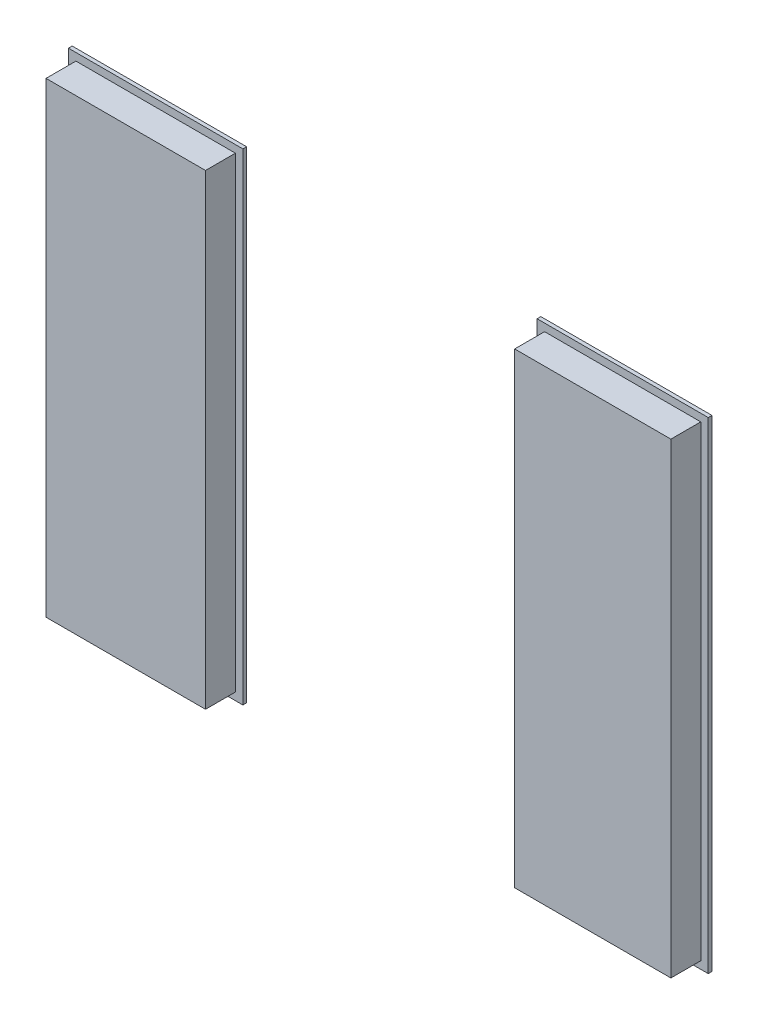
ISO-10303-21;
HEADER;
FILE_DESCRIPTION(('STEP AP214'),'2;1');
FILE_NAME('part.step','',(''),(''),'','','');
FILE_SCHEMA(('AUTOMOTIVE_DESIGN { 1 0 10303 214 1 1 1 1 }'));
ENDSEC;
DATA;
#1=APPLICATION_CONTEXT('core data for automotive mechanical design processes');
#2=APPLICATION_PROTOCOL_DEFINITION('international standard','automotive_design',2000,#1);
#3=PRODUCT_CONTEXT('',#1,'mechanical');
#4=PRODUCT('Part','Part','',(#3));
#5=PRODUCT_RELATED_PRODUCT_CATEGORY('part','',(#4));
#6=PRODUCT_DEFINITION_FORMATION('','',#4);
#7=PRODUCT_DEFINITION_CONTEXT('part definition',#1,'design');
#8=PRODUCT_DEFINITION('design','',#6,#7);
#9=PRODUCT_DEFINITION_SHAPE('','',#8);
#10=(LENGTH_UNIT() NAMED_UNIT(*) SI_UNIT(.MILLI.,.METRE.));
#11=(NAMED_UNIT(*) PLANE_ANGLE_UNIT() SI_UNIT($,.RADIAN.));
#12=(NAMED_UNIT(*) SI_UNIT($,.STERADIAN.) SOLID_ANGLE_UNIT());
#13=UNCERTAINTY_MEASURE_WITH_UNIT(LENGTH_MEASURE(1.E-05),#10,'distance_accuracy_value','');
#14=(GEOMETRIC_REPRESENTATION_CONTEXT(3) GLOBAL_UNCERTAINTY_ASSIGNED_CONTEXT((#13)) GLOBAL_UNIT_ASSIGNED_CONTEXT((#10,
#11,#12)) REPRESENTATION_CONTEXT('',''));
#15=CARTESIAN_POINT('',(0.,0.,0.));
#16=DIRECTION('',(0.,0.,1.));
#17=DIRECTION('',(1.,0.,0.));
#18=AXIS2_PLACEMENT_3D('',#15,#16,#17);
#19=CARTESIAN_POINT('',(84.3188543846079,0.,0.25));
#20=DIRECTION('',(-1.,0.,0.));
#21=DIRECTION('',(0.,0.,1.));
#22=AXIS2_PLACEMENT_3D('',#19,#20,#21);
#23=PLANE('',#22);
#24=DIRECTION('',(0.,1.,0.));
#25=VECTOR('',#24,1.);
#26=CARTESIAN_POINT('',(84.3188543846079,0.,0.));
#27=LINE('',#26,#25);
#28=CARTESIAN_POINT('',(84.3188543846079,58.1460403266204,0.));
#29=VERTEX_POINT('',#28);
#30=CARTESIAN_POINT('',(84.3188543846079,90.3740492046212,0.));
#31=VERTEX_POINT('',#30);
#32=EDGE_CURVE('E151',#29,#31,#27,.T.);
#33=ORIENTED_EDGE('',*,*,#32,.T.);
#34=DIRECTION('',(0.,0.,-1.));
#35=VECTOR('',#34,1.);
#36=CARTESIAN_POINT('',(84.3188543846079,90.3740492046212,0.25));
#37=LINE('',#36,#35);
#38=CARTESIAN_POINT('',(84.3188543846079,90.3740492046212,0.25));
#39=VERTEX_POINT('',#38);
#40=EDGE_CURVE('E12',#39,#31,#37,.T.);
#41=ORIENTED_EDGE('',*,*,#40,.F.);
#42=DIRECTION('',(0.,1.,0.));
#43=VECTOR('',#42,1.);
#44=CARTESIAN_POINT('',(84.3188543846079,0.,0.25));
#45=LINE('',#44,#43);
#46=CARTESIAN_POINT('',(84.3188543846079,58.1460403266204,0.25));
#47=VERTEX_POINT('',#46);
#48=EDGE_CURVE('E125',#47,#39,#45,.T.);
#49=ORIENTED_EDGE('',*,*,#48,.F.);
#50=DIRECTION('',(0.,0.,-1.));
#51=VECTOR('',#50,1.);
#52=CARTESIAN_POINT('',(84.3188543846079,58.1460403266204,0.25));
#53=LINE('',#52,#51);
#54=EDGE_CURVE('E158',#47,#29,#53,.T.);
#55=ORIENTED_EDGE('',*,*,#54,.T.);
#56=EDGE_LOOP('',(#33,#41,#49,#55));
#57=FACE_BOUND('',#56,.T.);
#58=ADVANCED_FACE('F44',(#57),#23,.F.);
#59=CARTESIAN_POINT('',(0.,90.3740492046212,0.25));
#60=DIRECTION('',(0.,-1.,0.));
#61=DIRECTION('',(0.,0.,-1.));
#62=AXIS2_PLACEMENT_3D('',#59,#60,#61);
#63=PLANE('',#62);
#64=DIRECTION('',(-1.,0.,0.));
#65=VECTOR('',#64,1.);
#66=CARTESIAN_POINT('',(0.,90.3740492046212,0.));
#67=LINE('',#66,#65);
#68=CARTESIAN_POINT('',(72.8657810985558,90.3740492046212,0.));
#69=VERTEX_POINT('',#68);
#70=EDGE_CURVE('E130',#31,#69,#67,.T.);
#71=ORIENTED_EDGE('',*,*,#70,.T.);
#72=DIRECTION('',(0.,0.,-1.));
#73=VECTOR('',#72,1.);
#74=CARTESIAN_POINT('',(72.8657810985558,90.3740492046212,0.25));
#75=LINE('',#74,#73);
#76=CARTESIAN_POINT('',(72.8657810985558,90.3740492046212,0.25));
#77=VERTEX_POINT('',#76);
#78=EDGE_CURVE('E54',#77,#69,#75,.T.);
#79=ORIENTED_EDGE('',*,*,#78,.F.);
#80=DIRECTION('',(-1.,0.,0.));
#81=VECTOR('',#80,1.);
#82=CARTESIAN_POINT('',(0.,90.3740492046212,0.25));
#83=LINE('',#82,#81);
#84=EDGE_CURVE('E119',#39,#77,#83,.T.);
#85=ORIENTED_EDGE('',*,*,#84,.F.);
#86=ORIENTED_EDGE('',*,*,#40,.T.);
#87=EDGE_LOOP('',(#71,#79,#85,#86));
#88=FACE_BOUND('',#87,.T.);
#89=ADVANCED_FACE('F129',(#88),#63,.F.);
#90=CARTESIAN_POINT('',(72.8657810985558,0.,0.25));
#91=DIRECTION('',(1.,0.,0.));
#92=DIRECTION('',(0.,0.,-1.));
#93=AXIS2_PLACEMENT_3D('',#90,#91,#92);
#94=PLANE('',#93);
#95=DIRECTION('',(0.,-1.,0.));
#96=VECTOR('',#95,1.);
#97=CARTESIAN_POINT('',(72.8657810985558,0.,0.));
#98=LINE('',#97,#96);
#99=CARTESIAN_POINT('',(72.8657810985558,58.1460403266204,0.));
#100=VERTEX_POINT('',#99);
#101=EDGE_CURVE('E92',#69,#100,#98,.T.);
#102=ORIENTED_EDGE('',*,*,#101,.T.);
#103=DIRECTION('',(0.,0.,-1.));
#104=VECTOR('',#103,1.);
#105=CARTESIAN_POINT('',(72.8657810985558,58.1460403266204,0.25));
#106=LINE('',#105,#104);
#107=CARTESIAN_POINT('',(72.8657810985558,58.1460403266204,0.25));
#108=VERTEX_POINT('',#107);
#109=EDGE_CURVE('E131',#108,#100,#106,.T.);
#110=ORIENTED_EDGE('',*,*,#109,.F.);
#111=DIRECTION('',(0.,-1.,0.));
#112=VECTOR('',#111,1.);
#113=CARTESIAN_POINT('',(72.8657810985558,0.,0.25));
#114=LINE('',#113,#112);
#115=EDGE_CURVE('E123',#77,#108,#114,.T.);
#116=ORIENTED_EDGE('',*,*,#115,.F.);
#117=ORIENTED_EDGE('',*,*,#78,.T.);
#118=EDGE_LOOP('',(#102,#110,#116,#117));
#119=FACE_BOUND('',#118,.T.);
#120=ADVANCED_FACE('F133',(#119),#94,.F.);
#121=CARTESIAN_POINT('',(0.,89.8740492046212,0.25));
#122=DIRECTION('',(0.,-1.,0.));
#123=DIRECTION('',(0.,0.,-1.));
#124=AXIS2_PLACEMENT_3D('',#121,#122,#123);
#125=PLANE('',#124);
#126=DIRECTION('',(-1.,0.,0.));
#127=VECTOR('',#126,1.);
#128=CARTESIAN_POINT('',(0.,89.8740492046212,0.));
#129=LINE('',#128,#127);
#130=CARTESIAN_POINT('',(83.8188543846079,89.8740492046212,0.));
#131=VERTEX_POINT('',#130);
#132=CARTESIAN_POINT('',(73.3657810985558,89.8740492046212,0.));
#133=VERTEX_POINT('',#132);
#134=EDGE_CURVE('E139',#131,#133,#129,.T.);
#135=ORIENTED_EDGE('',*,*,#134,.F.);
#136=DIRECTION('',(0.,0.,-1.));
#137=VECTOR('',#136,1.);
#138=CARTESIAN_POINT('',(83.8188543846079,89.8740492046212,0.25));
#139=LINE('',#138,#137);
#140=CARTESIAN_POINT('',(83.8188543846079,89.8740492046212,0.25));
#141=VERTEX_POINT('',#140);
#142=EDGE_CURVE('E48',#141,#131,#139,.T.);
#143=ORIENTED_EDGE('',*,*,#142,.F.);
#144=DIRECTION('',(-1.,0.,0.));
#145=VECTOR('',#144,1.);
#146=CARTESIAN_POINT('',(0.,89.8740492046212,0.25));
#147=LINE('',#146,#145);
#148=CARTESIAN_POINT('',(73.3657810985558,89.8740492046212,0.25));
#149=VERTEX_POINT('',#148);
#150=EDGE_CURVE('E157',#141,#149,#147,.T.);
#151=ORIENTED_EDGE('',*,*,#150,.T.);
#152=DIRECTION('',(0.,0.,-1.));
#153=VECTOR('',#152,1.);
#154=CARTESIAN_POINT('',(73.3657810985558,89.8740492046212,0.25));
#155=LINE('',#154,#153);
#156=EDGE_CURVE('E135',#149,#133,#155,.T.);
#157=ORIENTED_EDGE('',*,*,#156,.T.);
#158=EDGE_LOOP('',(#135,#143,#151,#157));
#159=FACE_BOUND('',#158,.T.);
#160=ADVANCED_FACE('F46',(#159),#125,.T.);
#161=CARTESIAN_POINT('',(83.8188543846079,0.,0.25));
#162=DIRECTION('',(-1.,0.,0.));
#163=DIRECTION('',(0.,0.,1.));
#164=AXIS2_PLACEMENT_3D('',#161,#162,#163);
#165=PLANE('',#164);
#166=DIRECTION('',(0.,1.,0.));
#167=VECTOR('',#166,1.);
#168=CARTESIAN_POINT('',(83.8188543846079,0.,0.));
#169=LINE('',#168,#167);
#170=CARTESIAN_POINT('',(83.8188543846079,58.6460403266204,0.));
#171=VERTEX_POINT('',#170);
#172=EDGE_CURVE('E142',#171,#131,#169,.T.);
#173=ORIENTED_EDGE('',*,*,#172,.F.);
#174=DIRECTION('',(0.,0.,-1.));
#175=VECTOR('',#174,1.);
#176=CARTESIAN_POINT('',(83.8188543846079,58.6460403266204,0.25));
#177=LINE('',#176,#175);
#178=CARTESIAN_POINT('',(83.8188543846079,58.6460403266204,0.25));
#179=VERTEX_POINT('',#178);
#180=EDGE_CURVE('E163',#179,#171,#177,.T.);
#181=ORIENTED_EDGE('',*,*,#180,.F.);
#182=DIRECTION('',(0.,1.,0.));
#183=VECTOR('',#182,1.);
#184=CARTESIAN_POINT('',(83.8188543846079,0.,0.25));
#185=LINE('',#184,#183);
#186=EDGE_CURVE('E172',#179,#141,#185,.T.);
#187=ORIENTED_EDGE('',*,*,#186,.T.);
#188=ORIENTED_EDGE('',*,*,#142,.T.);
#189=EDGE_LOOP('',(#173,#181,#187,#188));
#190=FACE_BOUND('',#189,.T.);
#191=ADVANCED_FACE('F170',(#190),#165,.T.);
#192=CARTESIAN_POINT('',(0.,58.6460403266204,0.25));
#193=DIRECTION('',(0.,1.,0.));
#194=DIRECTION('',(0.,0.,1.));
#195=AXIS2_PLACEMENT_3D('',#192,#193,#194);
#196=PLANE('',#195);
#197=DIRECTION('',(1.,0.,0.));
#198=VECTOR('',#197,1.);
#199=CARTESIAN_POINT('',(0.,58.6460403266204,0.));
#200=LINE('',#199,#198);
#201=CARTESIAN_POINT('',(73.3657810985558,58.6460403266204,0.));
#202=VERTEX_POINT('',#201);
#203=EDGE_CURVE('E145',#202,#171,#200,.T.);
#204=ORIENTED_EDGE('',*,*,#203,.F.);
#205=DIRECTION('',(0.,0.,-1.));
#206=VECTOR('',#205,1.);
#207=CARTESIAN_POINT('',(73.3657810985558,58.6460403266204,0.25));
#208=LINE('',#207,#206);
#209=CARTESIAN_POINT('',(73.3657810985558,58.6460403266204,0.25));
#210=VERTEX_POINT('',#209);
#211=EDGE_CURVE('E162',#210,#202,#208,.T.);
#212=ORIENTED_EDGE('',*,*,#211,.F.);
#213=DIRECTION('',(1.,0.,0.));
#214=VECTOR('',#213,1.);
#215=CARTESIAN_POINT('',(0.,58.6460403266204,0.25));
#216=LINE('',#215,#214);
#217=EDGE_CURVE('E179',#210,#179,#216,.T.);
#218=ORIENTED_EDGE('',*,*,#217,.T.);
#219=ORIENTED_EDGE('',*,*,#180,.T.);
#220=EDGE_LOOP('',(#204,#212,#218,#219));
#221=FACE_BOUND('',#220,.T.);
#222=ADVANCED_FACE('F177',(#221),#196,.T.);
#223=CARTESIAN_POINT('',(73.3657810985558,0.,0.25));
#224=DIRECTION('',(1.,0.,0.));
#225=DIRECTION('',(0.,0.,-1.));
#226=AXIS2_PLACEMENT_3D('',#223,#224,#225);
#227=PLANE('',#226);
#228=DIRECTION('',(0.,-1.,0.));
#229=VECTOR('',#228,1.);
#230=CARTESIAN_POINT('',(73.3657810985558,0.,0.));
#231=LINE('',#230,#229);
#232=EDGE_CURVE('E148',#133,#202,#231,.T.);
#233=ORIENTED_EDGE('',*,*,#232,.F.);
#234=ORIENTED_EDGE('',*,*,#156,.F.);
#235=DIRECTION('',(0.,-1.,0.));
#236=VECTOR('',#235,1.);
#237=CARTESIAN_POINT('',(73.3657810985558,0.,0.25));
#238=LINE('',#237,#236);
#239=EDGE_CURVE('E184',#149,#210,#238,.T.);
#240=ORIENTED_EDGE('',*,*,#239,.T.);
#241=ORIENTED_EDGE('',*,*,#211,.T.);
#242=EDGE_LOOP('',(#233,#234,#240,#241));
#243=FACE_BOUND('',#242,.T.);
#244=ADVANCED_FACE('F186',(#243),#227,.T.);
#245=CARTESIAN_POINT('',(0.,58.1460403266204,0.25));
#246=DIRECTION('',(0.,1.,0.));
#247=DIRECTION('',(0.,0.,1.));
#248=AXIS2_PLACEMENT_3D('',#245,#246,#247);
#249=PLANE('',#248);
#250=DIRECTION('',(1.,0.,0.));
#251=VECTOR('',#250,1.);
#252=CARTESIAN_POINT('',(0.,58.1460403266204,0.));
#253=LINE('',#252,#251);
#254=EDGE_CURVE('E98',#100,#29,#253,.T.);
#255=ORIENTED_EDGE('',*,*,#254,.T.);
#256=ORIENTED_EDGE('',*,*,#54,.F.);
#257=DIRECTION('',(1.,0.,0.));
#258=VECTOR('',#257,1.);
#259=CARTESIAN_POINT('',(0.,58.1460403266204,0.25));
#260=LINE('',#259,#258);
#261=EDGE_CURVE('E63',#108,#47,#260,.T.);
#262=ORIENTED_EDGE('',*,*,#261,.F.);
#263=ORIENTED_EDGE('',*,*,#109,.T.);
#264=EDGE_LOOP('',(#255,#256,#262,#263));
#265=FACE_BOUND('',#264,.T.);
#266=ADVANCED_FACE('F191',(#265),#249,.F.);
#267=CARTESIAN_POINT('',(0.,0.,0.25));
#268=DIRECTION('',(0.,0.,1.));
#269=DIRECTION('',(1.,0.,0.));
#270=AXIS2_PLACEMENT_3D('',#267,#268,#269);
#271=PLANE('',#270);
#272=ORIENTED_EDGE('',*,*,#150,.F.);
#273=ORIENTED_EDGE('',*,*,#186,.F.);
#274=ORIENTED_EDGE('',*,*,#217,.F.);
#275=ORIENTED_EDGE('',*,*,#239,.F.);
#276=EDGE_LOOP('',(#272,#273,#274,#275));
#277=FACE_BOUND('',#276,.T.);
#278=ORIENTED_EDGE('',*,*,#48,.T.);
#279=ORIENTED_EDGE('',*,*,#84,.T.);
#280=ORIENTED_EDGE('',*,*,#115,.T.);
#281=ORIENTED_EDGE('',*,*,#261,.T.);
#282=EDGE_LOOP('',(#278,#279,#280,#281));
#283=FACE_BOUND('',#282,.T.);
#284=ADVANCED_FACE('F121',(#277,#283),#271,.T.);
#285=CARTESIAN_POINT('',(0.,0.,0.));
#286=DIRECTION('',(0.,0.,1.));
#287=DIRECTION('',(1.,0.,0.));
#288=AXIS2_PLACEMENT_3D('',#285,#286,#287);
#289=PLANE('',#288);
#290=ORIENTED_EDGE('',*,*,#134,.T.);
#291=ORIENTED_EDGE('',*,*,#232,.T.);
#292=ORIENTED_EDGE('',*,*,#203,.T.);
#293=ORIENTED_EDGE('',*,*,#172,.T.);
#294=EDGE_LOOP('',(#290,#291,#292,#293));
#295=FACE_BOUND('',#294,.T.);
#296=ORIENTED_EDGE('',*,*,#32,.F.);
#297=ORIENTED_EDGE('',*,*,#254,.F.);
#298=ORIENTED_EDGE('',*,*,#101,.F.);
#299=ORIENTED_EDGE('',*,*,#70,.F.);
#300=EDGE_LOOP('',(#296,#297,#298,#299));
#301=FACE_BOUND('',#300,.T.);
#302=ADVANCED_FACE('F175',(#295,#301),#289,.F.);
#303=CLOSED_SHELL('',(#58,#89,#120,#160,#191,#222,#244,#266,#284,#302));
#304=MANIFOLD_SOLID_BREP('B2',#303);
#305=CARTESIAN_POINT('',(83.8188543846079,0.,2.25));
#306=DIRECTION('',(-1.,0.,0.));
#307=DIRECTION('',(0.,0.,1.));
#308=AXIS2_PLACEMENT_3D('',#305,#306,#307);
#309=PLANE('',#308);
#310=DIRECTION('',(0.,1.,0.));
#311=VECTOR('',#310,1.);
#312=CARTESIAN_POINT('',(83.8188543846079,0.,0.));
#313=LINE('',#312,#311);
#314=CARTESIAN_POINT('',(83.8188543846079,58.6460403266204,0.));
#315=VERTEX_POINT('',#314);
#316=CARTESIAN_POINT('',(83.8188543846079,89.8740492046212,0.));
#317=VERTEX_POINT('',#316);
#318=EDGE_CURVE('E346',#315,#317,#313,.T.);
#319=ORIENTED_EDGE('',*,*,#318,.T.);
#320=DIRECTION('',(0.,0.,-1.));
#321=VECTOR('',#320,1.);
#322=CARTESIAN_POINT('',(83.8188543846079,89.8740492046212,2.25));
#323=LINE('',#322,#321);
#324=CARTESIAN_POINT('',(83.8188543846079,89.8740492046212,2.25));
#325=VERTEX_POINT('',#324);
#326=EDGE_CURVE('E42',#325,#317,#323,.T.);
#327=ORIENTED_EDGE('',*,*,#326,.F.);
#328=DIRECTION('',(0.,1.,0.));
#329=VECTOR('',#328,1.);
#330=CARTESIAN_POINT('',(83.8188543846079,0.,2.25));
#331=LINE('',#330,#329);
#332=CARTESIAN_POINT('',(83.8188543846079,58.6460403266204,2.25));
#333=VERTEX_POINT('',#332);
#334=EDGE_CURVE('E334',#333,#325,#331,.T.);
#335=ORIENTED_EDGE('',*,*,#334,.F.);
#336=DIRECTION('',(0.,0.,-1.));
#337=VECTOR('',#336,1.);
#338=CARTESIAN_POINT('',(83.8188543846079,58.6460403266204,2.25));
#339=LINE('',#338,#337);
#340=EDGE_CURVE('E342',#333,#315,#339,.T.);
#341=ORIENTED_EDGE('',*,*,#340,.T.);
#342=EDGE_LOOP('',(#319,#327,#335,#341));
#343=FACE_BOUND('',#342,.T.);
#344=ADVANCED_FACE('F283',(#343),#309,.F.);
#345=CARTESIAN_POINT('',(0.,89.8740492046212,2.25));
#346=DIRECTION('',(0.,-1.,0.));
#347=DIRECTION('',(0.,0.,-1.));
#348=AXIS2_PLACEMENT_3D('',#345,#346,#347);
#349=PLANE('',#348);
#350=DIRECTION('',(-1.,0.,0.));
#351=VECTOR('',#350,1.);
#352=CARTESIAN_POINT('',(0.,89.8740492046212,0.));
#353=LINE('',#352,#351);
#354=CARTESIAN_POINT('',(73.3657810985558,89.8740492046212,0.));
#355=VERTEX_POINT('',#354);
#356=EDGE_CURVE('E338',#317,#355,#353,.T.);
#357=ORIENTED_EDGE('',*,*,#356,.T.);
#358=DIRECTION('',(0.,0.,-1.));
#359=VECTOR('',#358,1.);
#360=CARTESIAN_POINT('',(73.3657810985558,89.8740492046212,2.25));
#361=LINE('',#360,#359);
#362=CARTESIAN_POINT('',(73.3657810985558,89.8740492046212,2.25));
#363=VERTEX_POINT('',#362);
#364=EDGE_CURVE('E291',#363,#355,#361,.T.);
#365=ORIENTED_EDGE('',*,*,#364,.F.);
#366=DIRECTION('',(-1.,0.,0.));
#367=VECTOR('',#366,1.);
#368=CARTESIAN_POINT('',(0.,89.8740492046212,2.25));
#369=LINE('',#368,#367);
#370=EDGE_CURVE('E329',#325,#363,#369,.T.);
#371=ORIENTED_EDGE('',*,*,#370,.F.);
#372=ORIENTED_EDGE('',*,*,#326,.T.);
#373=EDGE_LOOP('',(#357,#365,#371,#372));
#374=FACE_BOUND('',#373,.T.);
#375=ADVANCED_FACE('F337',(#374),#349,.F.);
#376=CARTESIAN_POINT('',(73.3657810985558,0.,2.25));
#377=DIRECTION('',(1.,0.,0.));
#378=DIRECTION('',(0.,0.,-1.));
#379=AXIS2_PLACEMENT_3D('',#376,#377,#378);
#380=PLANE('',#379);
#381=DIRECTION('',(0.,-1.,0.));
#382=VECTOR('',#381,1.);
#383=CARTESIAN_POINT('',(73.3657810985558,0.,0.));
#384=LINE('',#383,#382);
#385=CARTESIAN_POINT('',(73.3657810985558,58.6460403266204,0.));
#386=VERTEX_POINT('',#385);
#387=EDGE_CURVE('E316',#355,#386,#384,.T.);
#388=ORIENTED_EDGE('',*,*,#387,.T.);
#389=DIRECTION('',(0.,0.,-1.));
#390=VECTOR('',#389,1.);
#391=CARTESIAN_POINT('',(73.3657810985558,58.6460403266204,2.25));
#392=LINE('',#391,#390);
#393=CARTESIAN_POINT('',(73.3657810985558,58.6460403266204,2.25));
#394=VERTEX_POINT('',#393);
#395=EDGE_CURVE('E339',#394,#386,#392,.T.);
#396=ORIENTED_EDGE('',*,*,#395,.F.);
#397=DIRECTION('',(0.,-1.,0.));
#398=VECTOR('',#397,1.);
#399=CARTESIAN_POINT('',(73.3657810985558,0.,2.25));
#400=LINE('',#399,#398);
#401=EDGE_CURVE('E332',#363,#394,#400,.T.);
#402=ORIENTED_EDGE('',*,*,#401,.F.);
#403=ORIENTED_EDGE('',*,*,#364,.T.);
#404=EDGE_LOOP('',(#388,#396,#402,#403));
#405=FACE_BOUND('',#404,.T.);
#406=ADVANCED_FACE('F340',(#405),#380,.F.);
#407=CARTESIAN_POINT('',(0.,58.6460403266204,2.25));
#408=DIRECTION('',(0.,1.,0.));
#409=DIRECTION('',(0.,0.,1.));
#410=AXIS2_PLACEMENT_3D('',#407,#408,#409);
#411=PLANE('',#410);
#412=DIRECTION('',(1.,0.,0.));
#413=VECTOR('',#412,1.);
#414=CARTESIAN_POINT('',(0.,58.6460403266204,0.));
#415=LINE('',#414,#413);
#416=EDGE_CURVE('E322',#386,#315,#415,.T.);
#417=ORIENTED_EDGE('',*,*,#416,.T.);
#418=ORIENTED_EDGE('',*,*,#340,.F.);
#419=DIRECTION('',(1.,0.,0.));
#420=VECTOR('',#419,1.);
#421=CARTESIAN_POINT('',(0.,58.6460403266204,2.25));
#422=LINE('',#421,#420);
#423=EDGE_CURVE('E299',#394,#333,#422,.T.);
#424=ORIENTED_EDGE('',*,*,#423,.F.);
#425=ORIENTED_EDGE('',*,*,#395,.T.);
#426=EDGE_LOOP('',(#417,#418,#424,#425));
#427=FACE_BOUND('',#426,.T.);
#428=ADVANCED_FACE('F353',(#427),#411,.F.);
#429=CARTESIAN_POINT('',(0.,0.,2.25));
#430=DIRECTION('',(0.,0.,1.));
#431=DIRECTION('',(1.,0.,0.));
#432=AXIS2_PLACEMENT_3D('',#429,#430,#431);
#433=PLANE('',#432);
#434=ORIENTED_EDGE('',*,*,#334,.T.);
#435=ORIENTED_EDGE('',*,*,#370,.T.);
#436=ORIENTED_EDGE('',*,*,#401,.T.);
#437=ORIENTED_EDGE('',*,*,#423,.T.);
#438=EDGE_LOOP('',(#434,#435,#436,#437));
#439=FACE_BOUND('',#438,.T.);
#440=ADVANCED_FACE('F330',(#439),#433,.T.);
#441=CARTESIAN_POINT('',(0.,0.,0.));
#442=DIRECTION('',(0.,0.,1.));
#443=DIRECTION('',(1.,0.,0.));
#444=AXIS2_PLACEMENT_3D('',#441,#442,#443);
#445=PLANE('',#444);
#446=ORIENTED_EDGE('',*,*,#318,.F.);
#447=ORIENTED_EDGE('',*,*,#416,.F.);
#448=ORIENTED_EDGE('',*,*,#387,.F.);
#449=ORIENTED_EDGE('',*,*,#356,.F.);
#450=EDGE_LOOP('',(#446,#447,#448,#449));
#451=FACE_BOUND('',#450,.T.);
#452=ADVANCED_FACE('F356',(#451),#445,.F.);
#453=CLOSED_SHELL('',(#344,#375,#406,#428,#440,#452));
#454=MANIFOLD_SOLID_BREP('B6',#453);
#455=CARTESIAN_POINT('',(42.0065612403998,0.,2.25));
#456=DIRECTION('',(-1.,0.,0.));
#457=DIRECTION('',(0.,0.,1.));
#458=AXIS2_PLACEMENT_3D('',#455,#456,#457);
#459=PLANE('',#458);
#460=DIRECTION('',(0.,1.,0.));
#461=VECTOR('',#460,1.);
#462=CARTESIAN_POINT('',(42.0065612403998,0.,0.25));
#463=LINE('',#462,#461);
#464=CARTESIAN_POINT('',(42.0065612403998,58.6460403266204,0.25));
#465=VERTEX_POINT('',#464);
#466=CARTESIAN_POINT('',(42.0065612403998,89.8740492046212,0.25));
#467=VERTEX_POINT('',#466);
#468=EDGE_CURVE('E421',#465,#467,#463,.T.);
#469=ORIENTED_EDGE('',*,*,#468,.F.);
#470=DIRECTION('',(0.,0.,-1.));
#471=VECTOR('',#470,1.);
#472=CARTESIAN_POINT('',(42.0065612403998,58.6460403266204,2.25));
#473=LINE('',#472,#471);
#474=CARTESIAN_POINT('',(42.0065612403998,58.6460403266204,2.25));
#475=VERTEX_POINT('',#474);
#476=EDGE_CURVE('E281',#475,#465,#473,.T.);
#477=ORIENTED_EDGE('',*,*,#476,.F.);
#478=DIRECTION('',(0.,1.,0.));
#479=VECTOR('',#478,1.);
#480=CARTESIAN_POINT('',(42.0065612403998,0.,2.25));
#481=LINE('',#480,#479);
#482=CARTESIAN_POINT('',(42.0065612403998,89.8740492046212,2.25));
#483=VERTEX_POINT('',#482);
#484=EDGE_CURVE('E482',#475,#483,#481,.T.);
#485=ORIENTED_EDGE('',*,*,#484,.T.);
#486=DIRECTION('',(0.,0.,-1.));
#487=VECTOR('',#486,1.);
#488=CARTESIAN_POINT('',(42.0065612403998,89.8740492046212,2.25));
#489=LINE('',#488,#487);
#490=EDGE_CURVE('E534',#483,#467,#489,.T.);
#491=ORIENTED_EDGE('',*,*,#490,.T.);
#492=EDGE_LOOP('',(#469,#477,#485,#491));
#493=FACE_BOUND('',#492,.T.);
#494=ADVANCED_FACE('F407',(#493),#459,.T.);
#495=CARTESIAN_POINT('',(0.,58.6460403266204,2.25));
#496=DIRECTION('',(0.,-1.,0.));
#497=DIRECTION('',(0.,0.,-1.));
#498=AXIS2_PLACEMENT_3D('',#495,#496,#497);
#499=PLANE('',#498);
#500=DIRECTION('',(-1.,0.,0.));
#501=VECTOR('',#500,1.);
#502=CARTESIAN_POINT('',(0.,58.6460403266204,0.25));
#503=LINE('',#502,#501);
#504=CARTESIAN_POINT('',(52.6785470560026,58.6460403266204,0.25));
#505=VERTEX_POINT('',#504);
#506=EDGE_CURVE('E427',#505,#465,#503,.T.);
#507=ORIENTED_EDGE('',*,*,#506,.F.);
#508=DIRECTION('',(0.,0.,-1.));
#509=VECTOR('',#508,1.);
#510=CARTESIAN_POINT('',(52.6785470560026,58.6460403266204,2.25));
#511=LINE('',#510,#509);
#512=CARTESIAN_POINT('',(52.6785470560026,58.6460403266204,2.25));
#513=VERTEX_POINT('',#512);
#514=EDGE_CURVE('E414',#513,#505,#511,.T.);
#515=ORIENTED_EDGE('',*,*,#514,.F.);
#516=DIRECTION('',(-1.,0.,0.));
#517=VECTOR('',#516,1.);
#518=CARTESIAN_POINT('',(0.,58.6460403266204,2.25));
#519=LINE('',#518,#517);
#520=EDGE_CURVE('E525',#513,#475,#519,.T.);
#521=ORIENTED_EDGE('',*,*,#520,.T.);
#522=ORIENTED_EDGE('',*,*,#476,.T.);
#523=EDGE_LOOP('',(#507,#515,#521,#522));
#524=FACE_BOUND('',#523,.T.);
#525=ADVANCED_FACE('F548',(#524),#499,.T.);
#526=CARTESIAN_POINT('',(52.6785470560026,0.,2.25));
#527=DIRECTION('',(1.,0.,0.));
#528=DIRECTION('',(0.,0.,-1.));
#529=AXIS2_PLACEMENT_3D('',#526,#527,#528);
#530=PLANE('',#529);
#531=DIRECTION('',(0.,-1.,0.));
#532=VECTOR('',#531,1.);
#533=CARTESIAN_POINT('',(52.6785470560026,0.,0.25));
#534=LINE('',#533,#532);
#535=CARTESIAN_POINT('',(52.6785470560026,89.8740492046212,0.25));
#536=VERTEX_POINT('',#535);
#537=EDGE_CURVE('E507',#536,#505,#534,.T.);
#538=ORIENTED_EDGE('',*,*,#537,.F.);
#539=DIRECTION('',(0.,0.,-1.));
#540=VECTOR('',#539,1.);
#541=CARTESIAN_POINT('',(52.6785470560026,89.8740492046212,2.25));
#542=LINE('',#541,#540);
#543=CARTESIAN_POINT('',(52.6785470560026,89.8740492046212,2.25));
#544=VERTEX_POINT('',#543);
#545=EDGE_CURVE('E536',#544,#536,#542,.T.);
#546=ORIENTED_EDGE('',*,*,#545,.F.);
#547=DIRECTION('',(0.,-1.,0.));
#548=VECTOR('',#547,1.);
#549=CARTESIAN_POINT('',(52.6785470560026,0.,2.25));
#550=LINE('',#549,#548);
#551=EDGE_CURVE('E528',#544,#513,#550,.T.);
#552=ORIENTED_EDGE('',*,*,#551,.T.);
#553=ORIENTED_EDGE('',*,*,#514,.T.);
#554=EDGE_LOOP('',(#538,#546,#552,#553));
#555=FACE_BOUND('',#554,.T.);
#556=ADVANCED_FACE('F539',(#555),#530,.T.);
#557=CARTESIAN_POINT('',(0.,89.8740492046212,2.25));
#558=DIRECTION('',(0.,1.,0.));
#559=DIRECTION('',(0.,0.,1.));
#560=AXIS2_PLACEMENT_3D('',#557,#558,#559);
#561=PLANE('',#560);
#562=DIRECTION('',(1.,0.,0.));
#563=VECTOR('',#562,1.);
#564=CARTESIAN_POINT('',(0.,89.8740492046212,0.25));
#565=LINE('',#564,#563);
#566=EDGE_CURVE('E504',#467,#536,#565,.T.);
#567=ORIENTED_EDGE('',*,*,#566,.F.);
#568=ORIENTED_EDGE('',*,*,#490,.F.);
#569=DIRECTION('',(1.,0.,0.));
#570=VECTOR('',#569,1.);
#571=CARTESIAN_POINT('',(0.,89.8740492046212,2.25));
#572=LINE('',#571,#570);
#573=EDGE_CURVE('E531',#483,#544,#572,.T.);
#574=ORIENTED_EDGE('',*,*,#573,.T.);
#575=ORIENTED_EDGE('',*,*,#545,.T.);
#576=EDGE_LOOP('',(#567,#568,#574,#575));
#577=FACE_BOUND('',#576,.T.);
#578=ADVANCED_FACE('F543',(#577),#561,.T.);
#579=CARTESIAN_POINT('',(0.,0.,2.25));
#580=DIRECTION('',(0.,0.,1.));
#581=DIRECTION('',(1.,0.,0.));
#582=AXIS2_PLACEMENT_3D('',#579,#580,#581);
#583=PLANE('',#582);
#584=ORIENTED_EDGE('',*,*,#484,.F.);
#585=ORIENTED_EDGE('',*,*,#520,.F.);
#586=ORIENTED_EDGE('',*,*,#551,.F.);
#587=ORIENTED_EDGE('',*,*,#573,.F.);
#588=EDGE_LOOP('',(#584,#585,#586,#587));
#589=FACE_BOUND('',#588,.T.);
#590=ADVANCED_FACE('F547',(#589),#583,.T.);
#591=CARTESIAN_POINT('',(41.5065612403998,0.,0.25));
#592=DIRECTION('',(-1.,0.,0.));
#593=DIRECTION('',(0.,0.,1.));
#594=AXIS2_PLACEMENT_3D('',#591,#592,#593);
#595=PLANE('',#594);
#596=DIRECTION('',(0.,1.,0.));
#597=VECTOR('',#596,1.);
#598=CARTESIAN_POINT('',(41.5065612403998,0.,0.));
#599=LINE('',#598,#597);
#600=CARTESIAN_POINT('',(41.5065612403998,58.1460403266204,0.));
#601=VERTEX_POINT('',#600);
#602=CARTESIAN_POINT('',(41.5065612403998,90.3740492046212,0.));
#603=VERTEX_POINT('',#602);
#604=EDGE_CURVE('E477',#601,#603,#599,.T.);
#605=ORIENTED_EDGE('',*,*,#604,.F.);
#606=DIRECTION('',(0.,0.,-1.));
#607=VECTOR('',#606,1.);
#608=CARTESIAN_POINT('',(41.5065612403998,58.1460403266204,0.25));
#609=LINE('',#608,#607);
#610=CARTESIAN_POINT('',(41.5065612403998,58.1460403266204,0.25));
#611=VERTEX_POINT('',#610);
#612=EDGE_CURVE('E471',#611,#601,#609,.T.);
#613=ORIENTED_EDGE('',*,*,#612,.F.);
#614=DIRECTION('',(0.,1.,0.));
#615=VECTOR('',#614,1.);
#616=CARTESIAN_POINT('',(41.5065612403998,0.,0.25));
#617=LINE('',#616,#615);
#618=CARTESIAN_POINT('',(41.5065612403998,90.3740492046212,0.25));
#619=VERTEX_POINT('',#618);
#620=EDGE_CURVE('E474',#611,#619,#617,.T.);
#621=ORIENTED_EDGE('',*,*,#620,.T.);
#622=DIRECTION('',(0.,0.,-1.));
#623=VECTOR('',#622,1.);
#624=CARTESIAN_POINT('',(41.5065612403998,90.3740492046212,0.25));
#625=LINE('',#624,#623);
#626=EDGE_CURVE('E510',#619,#603,#625,.T.);
#627=ORIENTED_EDGE('',*,*,#626,.T.);
#628=EDGE_LOOP('',(#605,#613,#621,#627));
#629=FACE_BOUND('',#628,.T.);
#630=ADVANCED_FACE('F473',(#629),#595,.T.);
#631=CARTESIAN_POINT('',(0.,58.1460403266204,0.25));
#632=DIRECTION('',(0.,-1.,0.));
#633=DIRECTION('',(0.,0.,-1.));
#634=AXIS2_PLACEMENT_3D('',#631,#632,#633);
#635=PLANE('',#634);
#636=DIRECTION('',(-1.,0.,0.));
#637=VECTOR('',#636,1.);
#638=CARTESIAN_POINT('',(0.,58.1460403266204,0.));
#639=LINE('',#638,#637);
#640=CARTESIAN_POINT('',(53.1785470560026,58.1460403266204,0.));
#641=VERTEX_POINT('',#640);
#642=EDGE_CURVE('E512',#641,#601,#639,.T.);
#643=ORIENTED_EDGE('',*,*,#642,.F.);
#644=DIRECTION('',(0.,0.,-1.));
#645=VECTOR('',#644,1.);
#646=CARTESIAN_POINT('',(53.1785470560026,58.1460403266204,0.25));
#647=LINE('',#646,#645);
#648=CARTESIAN_POINT('',(53.1785470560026,58.1460403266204,0.25));
#649=VERTEX_POINT('',#648);
#650=EDGE_CURVE('E483',#649,#641,#647,.T.);
#651=ORIENTED_EDGE('',*,*,#650,.F.);
#652=DIRECTION('',(-1.,0.,0.));
#653=VECTOR('',#652,1.);
#654=CARTESIAN_POINT('',(0.,58.1460403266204,0.25));
#655=LINE('',#654,#653);
#656=EDGE_CURVE('E490',#649,#611,#655,.T.);
#657=ORIENTED_EDGE('',*,*,#656,.T.);
#658=ORIENTED_EDGE('',*,*,#612,.T.);
#659=EDGE_LOOP('',(#643,#651,#657,#658));
#660=FACE_BOUND('',#659,.T.);
#661=ADVANCED_FACE('F496',(#660),#635,.T.);
#662=CARTESIAN_POINT('',(53.1785470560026,0.,0.25));
#663=DIRECTION('',(1.,0.,0.));
#664=DIRECTION('',(0.,0.,-1.));
#665=AXIS2_PLACEMENT_3D('',#662,#663,#664);
#666=PLANE('',#665);
#667=DIRECTION('',(0.,-1.,0.));
#668=VECTOR('',#667,1.);
#669=CARTESIAN_POINT('',(53.1785470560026,0.,0.));
#670=LINE('',#669,#668);
#671=CARTESIAN_POINT('',(53.1785470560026,90.3740492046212,0.));
#672=VERTEX_POINT('',#671);
#673=EDGE_CURVE('E514',#672,#641,#670,.T.);
#674=ORIENTED_EDGE('',*,*,#673,.F.);
#675=DIRECTION('',(0.,0.,-1.));
#676=VECTOR('',#675,1.);
#677=CARTESIAN_POINT('',(53.1785470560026,90.3740492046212,0.25));
#678=LINE('',#677,#676);
#679=CARTESIAN_POINT('',(53.1785470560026,90.3740492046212,0.25));
#680=VERTEX_POINT('',#679);
#681=EDGE_CURVE('E520',#680,#672,#678,.T.);
#682=ORIENTED_EDGE('',*,*,#681,.F.);
#683=DIRECTION('',(0.,-1.,0.));
#684=VECTOR('',#683,1.);
#685=CARTESIAN_POINT('',(53.1785470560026,0.,0.25));
#686=LINE('',#685,#684);
#687=EDGE_CURVE('E497',#680,#649,#686,.T.);
#688=ORIENTED_EDGE('',*,*,#687,.T.);
#689=ORIENTED_EDGE('',*,*,#650,.T.);
#690=EDGE_LOOP('',(#674,#682,#688,#689));
#691=FACE_BOUND('',#690,.T.);
#692=ADVANCED_FACE('F568',(#691),#666,.T.);
#693=CARTESIAN_POINT('',(0.,90.3740492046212,0.25));
#694=DIRECTION('',(0.,1.,0.));
#695=DIRECTION('',(0.,0.,1.));
#696=AXIS2_PLACEMENT_3D('',#693,#694,#695);
#697=PLANE('',#696);
#698=DIRECTION('',(1.,0.,0.));
#699=VECTOR('',#698,1.);
#700=CARTESIAN_POINT('',(0.,90.3740492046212,0.));
#701=LINE('',#700,#699);
#702=EDGE_CURVE('E494',#603,#672,#701,.T.);
#703=ORIENTED_EDGE('',*,*,#702,.F.);
#704=ORIENTED_EDGE('',*,*,#626,.F.);
#705=DIRECTION('',(1.,0.,0.));
#706=VECTOR('',#705,1.);
#707=CARTESIAN_POINT('',(0.,90.3740492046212,0.25));
#708=LINE('',#707,#706);
#709=EDGE_CURVE('E493',#619,#680,#708,.T.);
#710=ORIENTED_EDGE('',*,*,#709,.T.);
#711=ORIENTED_EDGE('',*,*,#681,.T.);
#712=EDGE_LOOP('',(#703,#704,#710,#711));
#713=FACE_BOUND('',#712,.T.);
#714=ADVANCED_FACE('F571',(#713),#697,.T.);
#715=CARTESIAN_POINT('',(0.,0.,0.25));
#716=DIRECTION('',(0.,0.,1.));
#717=DIRECTION('',(1.,0.,0.));
#718=AXIS2_PLACEMENT_3D('',#715,#716,#717);
#719=PLANE('',#718);
#720=ORIENTED_EDGE('',*,*,#620,.F.);
#721=ORIENTED_EDGE('',*,*,#656,.F.);
#722=ORIENTED_EDGE('',*,*,#687,.F.);
#723=ORIENTED_EDGE('',*,*,#709,.F.);
#724=EDGE_LOOP('',(#720,#721,#722,#723));
#725=FACE_BOUND('',#724,.T.);
#726=ORIENTED_EDGE('',*,*,#506,.T.);
#727=ORIENTED_EDGE('',*,*,#468,.T.);
#728=ORIENTED_EDGE('',*,*,#566,.T.);
#729=ORIENTED_EDGE('',*,*,#537,.T.);
#730=EDGE_LOOP('',(#726,#727,#728,#729));
#731=FACE_BOUND('',#730,.T.);
#732=ADVANCED_FACE('F487',(#725,#731),#719,.T.);
#733=CARTESIAN_POINT('',(0.,0.,0.));
#734=DIRECTION('',(0.,0.,1.));
#735=DIRECTION('',(1.,0.,0.));
#736=AXIS2_PLACEMENT_3D('',#733,#734,#735);
#737=PLANE('',#736);
#738=ORIENTED_EDGE('',*,*,#604,.T.);
#739=ORIENTED_EDGE('',*,*,#702,.T.);
#740=ORIENTED_EDGE('',*,*,#673,.T.);
#741=ORIENTED_EDGE('',*,*,#642,.T.);
#742=EDGE_LOOP('',(#738,#739,#740,#741));
#743=FACE_BOUND('',#742,.T.);
#744=ADVANCED_FACE('F558',(#743),#737,.F.);
#745=CLOSED_SHELL('',(#494,#525,#556,#578,#590,#630,#661,#692,#714,#732,#744));
#746=MANIFOLD_SOLID_BREP('B36',#745);
#747=ADVANCED_BREP_SHAPE_REPRESENTATION('',(#18,#304,#454,#746),#14);
#748=SHAPE_DEFINITION_REPRESENTATION(#9,#747);
ENDSEC;
END-ISO-10303-21;
